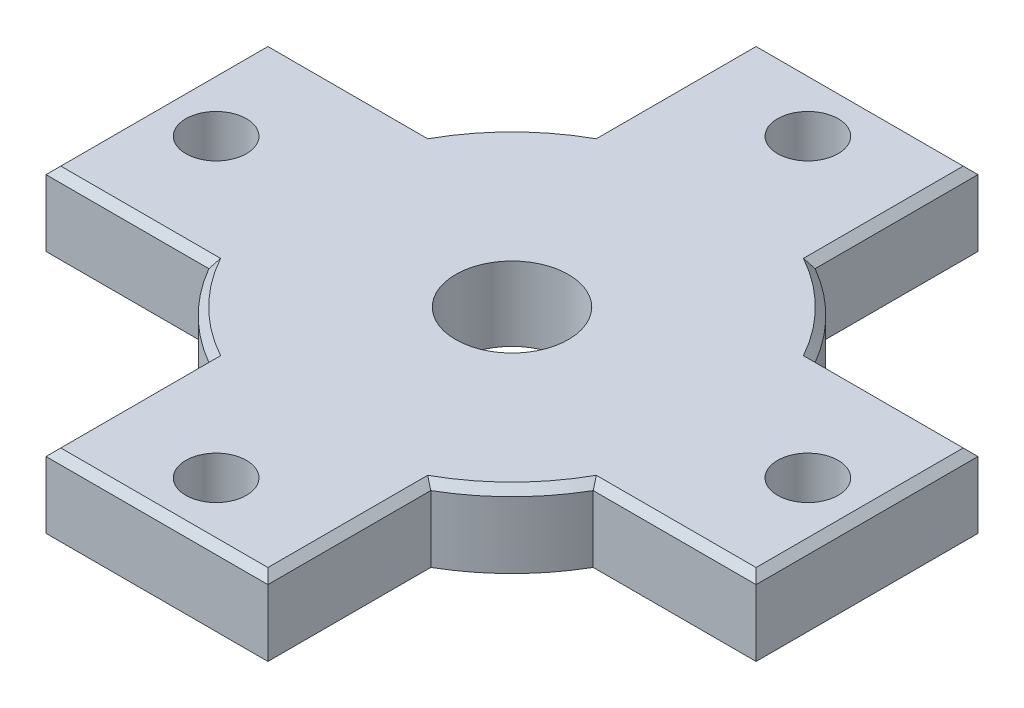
from build123d import *

# Parameters (mm, degrees)
EXTRUDE_1_DEPTH          = 10
CHAMFER_1_SIZE           = 1
HOLE_WIZARD_G3_8_1_D     = 15.25
HOLE_WIZARD_G3_8_1_DEPTH = 37.33
HOLE_WIZARD_G3_8_1_TIP   = 4.58156222
HOLE_WIZARD_8_2_8_2_1_D  = 8.2
PATTERN_CIRCULAR_1_COUNT = 4


with BuildPart() as part:
    # Sketch 1 → Extrude 1 (new body)
    with BuildSketch(Plane(origin=(0, 0, 0), x_dir=(1, 0, 0), z_dir=(0, 1, 0))):
        with BuildLine():
            Line((-15, 25.980762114), (-15, 48))
            Line((-15, 48), (15, 48))
            Line((15, 48), (15, 25.980762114))
            ThreePointArc((15, 25.980762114), (21.213203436, 21.213203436), (25.980762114, 15))
            Line((25.980762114, 15), (48, 15))
            Line((48, 15), (48, -15))
            Line((48, -15), (25.980762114, -15))
            ThreePointArc((25.980762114, -15), (21.213203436, -21.213203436), (15, -25.980762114))
            Line((15, -25.980762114), (15, -48))
            Line((15, -48), (-15, -48))
            Line((-15, -48), (-15, -25.980762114))
            ThreePointArc((-15, -25.980762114), (-21.213203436, -21.213203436), (-25.980762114, -15))
            Line((-25.980762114, -15), (-48, -15))
            Line((-48, -15), (-48, 15))
            Line((-48, 15), (-25.980762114, 15))
            ThreePointArc((-25.980762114, 15), (-21.213203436, 21.213203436), (-15, 25.980762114))
        make_face()
    extrude(amount=EXTRUDE_1_DEPTH)

    # Chamfer 1
    chamfer_1_edges = [part.edges().sort_by_distance(p)[0] for p in [
        (-48, 10, 0),
        (-36.990381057, 10, 15),
        (-21.213203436, 10, 21.213203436),
        (-15, 10, 36.990381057),
        (0, 10, 48),
        (15, 10, 36.990381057),
        (21.213203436, 10, 21.213203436),
        (36.990381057, 10, 15),
        (48, 10, 0),
        (36.990381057, 10, -15),
        (-21.213203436, 10, -21.213203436),
        (21.213203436, 10, -21.213203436),
        (15, 10, -36.990381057),
        (0, 10, -48),
        (-15, 10, -36.990381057),
        (-36.990381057, 10, -15),
    ]]
    chamfer(chamfer_1_edges, length=CHAMFER_1_SIZE)

    # Hole Wizard G3_8 _1
    with Locations(Plane(origin=(0, 10, 0), x_dir=(1, 0, 0), z_dir=(0, 1, 0))):
        with Locations((0, 0)):
            Hole(HOLE_WIZARD_G3_8_1_D / 2, depth=HOLE_WIZARD_G3_8_1_DEPTH)
            with Locations((0, 0, -(HOLE_WIZARD_G3_8_1_DEPTH + HOLE_WIZARD_G3_8_1_TIP / 2))):  # 118° drill point
                Cone(0, HOLE_WIZARD_G3_8_1_D / 2, HOLE_WIZARD_G3_8_1_TIP, mode=Mode.SUBTRACT)

    # Hole Wizard 8.2 _8.2_ _1 (through all)
    with Locations(Plane(origin=(0, 10, 0), x_dir=(1, 0, 0), z_dir=(0, 1, 0))):
        with Locations((0, -40)):
            hole_wizard_8_2_8_2_1 = Hole(HOLE_WIZARD_8_2_8_2_1_D / 2)

    # Pattern Circular 1: Hole Wizard 8.2 _8.2_ _1 ×4 about axis
    pattern_circular_1_axis = Axis((0, 0, 0), (0, 1, 0))
    for i in range(1, PATTERN_CIRCULAR_1_COUNT):
        add(hole_wizard_8_2_8_2_1.rotate(pattern_circular_1_axis, i * 360 / PATTERN_CIRCULAR_1_COUNT), mode=Mode.SUBTRACT)


solid = part.part
